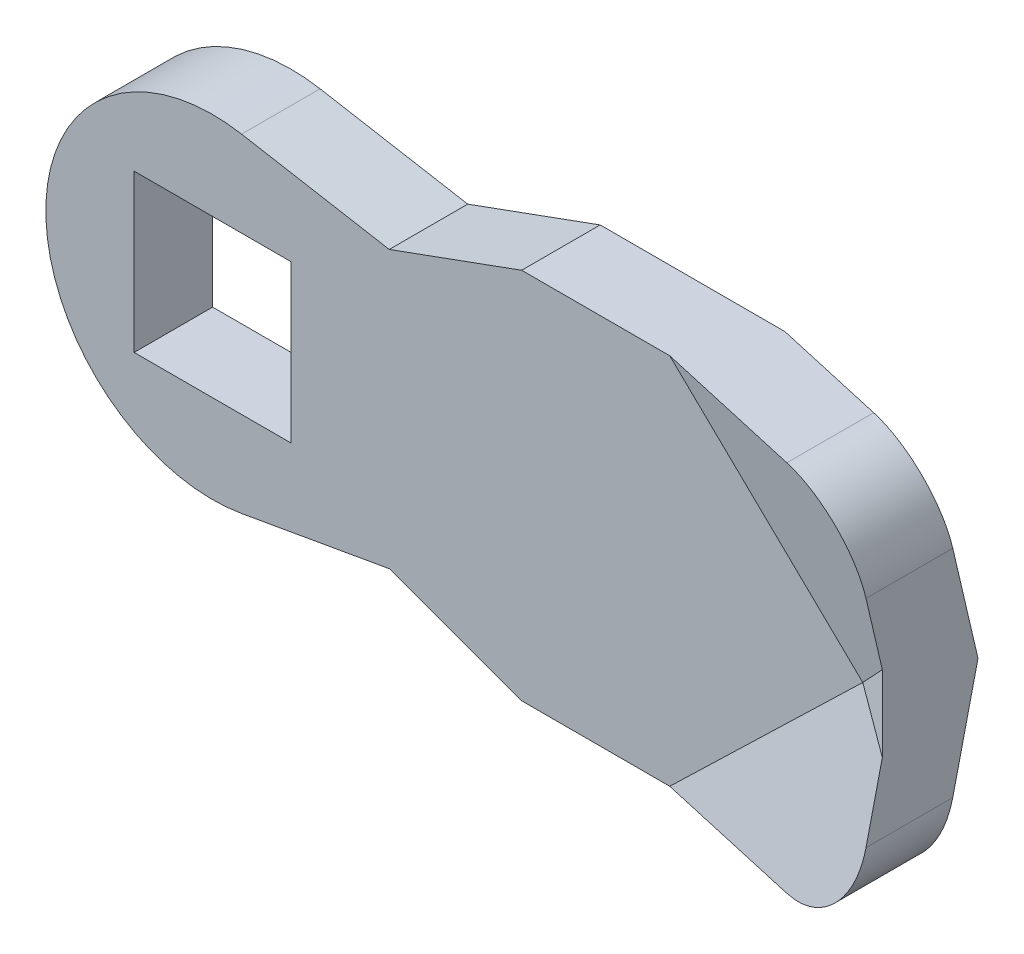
ISO-10303-21;
HEADER;
FILE_DESCRIPTION(('STEP AP214'),'2;1');
FILE_NAME('part.step','',(''),(''),'','','');
FILE_SCHEMA(('AUTOMOTIVE_DESIGN { 1 0 10303 214 1 1 1 1 }'));
ENDSEC;
DATA;
#1=APPLICATION_CONTEXT('core data for automotive mechanical design processes');
#2=APPLICATION_PROTOCOL_DEFINITION('international standard','automotive_design',2000,#1);
#3=PRODUCT_CONTEXT('',#1,'mechanical');
#4=PRODUCT('Part','Part','',(#3));
#5=PRODUCT_RELATED_PRODUCT_CATEGORY('part','',(#4));
#6=PRODUCT_DEFINITION_FORMATION('','',#4);
#7=PRODUCT_DEFINITION_CONTEXT('part definition',#1,'design');
#8=PRODUCT_DEFINITION('design','',#6,#7);
#9=PRODUCT_DEFINITION_SHAPE('','',#8);
#10=(LENGTH_UNIT() NAMED_UNIT(*) SI_UNIT(.MILLI.,.METRE.));
#11=(NAMED_UNIT(*) PLANE_ANGLE_UNIT() SI_UNIT($,.RADIAN.));
#12=(NAMED_UNIT(*) SI_UNIT($,.STERADIAN.) SOLID_ANGLE_UNIT());
#13=UNCERTAINTY_MEASURE_WITH_UNIT(LENGTH_MEASURE(1.E-05),#10,'distance_accuracy_value','');
#14=(GEOMETRIC_REPRESENTATION_CONTEXT(3) GLOBAL_UNCERTAINTY_ASSIGNED_CONTEXT((#13)) GLOBAL_UNIT_ASSIGNED_CONTEXT((#10,
#11,#12)) REPRESENTATION_CONTEXT('',''));
#15=CARTESIAN_POINT('',(0.,0.,0.));
#16=DIRECTION('',(0.,0.,1.));
#17=DIRECTION('',(1.,0.,0.));
#18=AXIS2_PLACEMENT_3D('',#15,#16,#17);
#19=CARTESIAN_POINT('',(6.5,2.8,-2.4));
#20=DIRECTION('',(0.,-1.,0.));
#21=DIRECTION('',(-1.,0.,0.));
#22=AXIS2_PLACEMENT_3D('',#19,#20,#21);
#23=PLANE('',#22);
#24=DIRECTION('',(0.707106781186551,0.,0.707106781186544));
#25=VECTOR('',#24,1.);
#26=CARTESIAN_POINT('',(7.5,2.8,-3.4));
#27=LINE('',#26,#25);
#28=CARTESIAN_POINT('',(8.5,2.8,-2.4));
#29=VERTEX_POINT('',#28);
#30=CARTESIAN_POINT('',(10.5,2.8,-0.400000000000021));
#31=VERTEX_POINT('',#30);
#32=EDGE_CURVE('E170',#29,#31,#27,.T.);
#33=ORIENTED_EDGE('',*,*,#32,.F.);
#34=DIRECTION('',(1.,0.,0.));
#35=VECTOR('',#34,1.);
#36=CARTESIAN_POINT('',(6.5,2.8,-2.4));
#37=LINE('',#36,#35);
#38=CARTESIAN_POINT('',(6.5,2.8,-2.4));
#39=VERTEX_POINT('',#38);
#40=EDGE_CURVE('E193',#39,#29,#37,.T.);
#41=ORIENTED_EDGE('',*,*,#40,.F.);
#42=DIRECTION('',(0.,0.,1.));
#43=VECTOR('',#42,1.);
#44=CARTESIAN_POINT('',(6.5,2.8,-2.4));
#45=LINE('',#44,#43);
#46=CARTESIAN_POINT('',(6.5,2.8,0.));
#47=VERTEX_POINT('',#46);
#48=EDGE_CURVE('E191',#39,#47,#45,.T.);
#49=ORIENTED_EDGE('',*,*,#48,.T.);
#50=DIRECTION('',(1.,0.,0.));
#51=VECTOR('',#50,1.);
#52=CARTESIAN_POINT('',(6.5,2.8,0.));
#53=LINE('',#52,#51);
#54=CARTESIAN_POINT('',(10.5,2.8,0.));
#55=VERTEX_POINT('',#54);
#56=EDGE_CURVE('E647',#47,#55,#53,.T.);
#57=ORIENTED_EDGE('',*,*,#56,.T.);
#58=DIRECTION('',(0.,0.,1.));
#59=VECTOR('',#58,1.);
#60=CARTESIAN_POINT('',(10.5,2.8,-2.4));
#61=LINE('',#60,#59);
#62=EDGE_CURVE('E188',#31,#55,#61,.T.);
#63=ORIENTED_EDGE('',*,*,#62,.F.);
#64=EDGE_LOOP('',(#33,#41,#49,#57,#63));
#65=FACE_BOUND('',#64,.T.);
#66=ADVANCED_FACE('F14',(#65),#23,.F.);
#67=CARTESIAN_POINT('',(10.5,-2.8,-2.4));
#68=DIRECTION('',(1.,0.,0.));
#69=DIRECTION('',(0.,-1.,0.));
#70=AXIS2_PLACEMENT_3D('',#67,#68,#69);
#71=PLANE('',#70);
#72=DIRECTION('',(0.,0.,1.));
#73=VECTOR('',#72,1.);
#74=CARTESIAN_POINT('',(10.5,-2.8,-2.4));
#75=LINE('',#74,#73);
#76=CARTESIAN_POINT('',(10.5,-2.8,-0.400000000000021));
#77=VERTEX_POINT('',#76);
#78=CARTESIAN_POINT('',(10.5,-2.8,0.));
#79=VERTEX_POINT('',#78);
#80=EDGE_CURVE('E180',#77,#79,#75,.T.);
#81=ORIENTED_EDGE('',*,*,#80,.F.);
#82=DIRECTION('',(0.,-1.,0.));
#83=VECTOR('',#82,1.);
#84=CARTESIAN_POINT('',(10.5,9.5,-0.400000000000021));
#85=LINE('',#84,#83);
#86=EDGE_CURVE('E167',#31,#77,#85,.T.);
#87=ORIENTED_EDGE('',*,*,#86,.F.);
#88=ORIENTED_EDGE('',*,*,#62,.T.);
#89=DIRECTION('',(0.,1.,0.));
#90=VECTOR('',#89,1.);
#91=CARTESIAN_POINT('',(10.5,-2.8,0.));
#92=LINE('',#91,#90);
#93=EDGE_CURVE('E187',#79,#55,#92,.T.);
#94=ORIENTED_EDGE('',*,*,#93,.F.);
#95=EDGE_LOOP('',(#81,#87,#88,#94));
#96=FACE_BOUND('',#95,.T.);
#97=ADVANCED_FACE('F185',(#96),#71,.T.);
#98=CARTESIAN_POINT('',(10.5,-2.8,-2.4));
#99=DIRECTION('',(0.,1.,0.));
#100=DIRECTION('',(1.,0.,0.));
#101=AXIS2_PLACEMENT_3D('',#98,#99,#100);
#102=PLANE('',#101);
#103=DIRECTION('',(0.707106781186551,0.,0.707106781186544));
#104=VECTOR('',#103,1.);
#105=CARTESIAN_POINT('',(8.5,-2.8,-2.4));
#106=LINE('',#105,#104);
#107=CARTESIAN_POINT('',(8.5,-2.8,-2.4));
#108=VERTEX_POINT('',#107);
#109=EDGE_CURVE('E29',#108,#77,#106,.T.);
#110=ORIENTED_EDGE('',*,*,#109,.T.);
#111=ORIENTED_EDGE('',*,*,#80,.T.);
#112=DIRECTION('',(-1.,0.,0.));
#113=VECTOR('',#112,1.);
#114=CARTESIAN_POINT('',(10.5,-2.8,0.));
#115=LINE('',#114,#113);
#116=CARTESIAN_POINT('',(6.5,-2.8,0.));
#117=VERTEX_POINT('',#116);
#118=EDGE_CURVE('E651',#79,#117,#115,.T.);
#119=ORIENTED_EDGE('',*,*,#118,.T.);
#120=DIRECTION('',(0.,0.,1.));
#121=VECTOR('',#120,1.);
#122=CARTESIAN_POINT('',(6.5,-2.8,-2.4));
#123=LINE('',#122,#121);
#124=CARTESIAN_POINT('',(6.5,-2.8,-2.4));
#125=VERTEX_POINT('',#124);
#126=EDGE_CURVE('E189',#125,#117,#123,.T.);
#127=ORIENTED_EDGE('',*,*,#126,.F.);
#128=DIRECTION('',(-1.,0.,0.));
#129=VECTOR('',#128,1.);
#130=CARTESIAN_POINT('',(10.5,-2.8,-2.4));
#131=LINE('',#130,#129);
#132=EDGE_CURVE('E182',#108,#125,#131,.T.);
#133=ORIENTED_EDGE('',*,*,#132,.F.);
#134=EDGE_LOOP('',(#110,#111,#119,#127,#133));
#135=FACE_BOUND('',#134,.T.);
#136=ADVANCED_FACE('F178',(#135),#102,.F.);
#137=CARTESIAN_POINT('',(6.5,-2.8,-2.4));
#138=DIRECTION('',(0.,0.,-1.));
#139=DIRECTION('',(1.,0.,0.));
#140=AXIS2_PLACEMENT_3D('',#137,#138,#139);
#141=PLANE('',#140);
#142=ORIENTED_EDGE('',*,*,#40,.T.);
#143=DIRECTION('',(0.,-1.,0.));
#144=VECTOR('',#143,1.);
#145=CARTESIAN_POINT('',(8.5,9.5,-2.4));
#146=LINE('',#145,#144);
#147=EDGE_CURVE('E174',#29,#108,#146,.T.);
#148=ORIENTED_EDGE('',*,*,#147,.T.);
#149=ORIENTED_EDGE('',*,*,#132,.T.);
#150=DIRECTION('',(0.,-1.,0.));
#151=VECTOR('',#150,1.);
#152=CARTESIAN_POINT('',(6.5,2.8,-2.4));
#153=LINE('',#152,#151);
#154=EDGE_CURVE('E643',#39,#125,#153,.T.);
#155=ORIENTED_EDGE('',*,*,#154,.F.);
#156=EDGE_LOOP('',(#142,#148,#149,#155));
#157=FACE_BOUND('',#156,.T.);
#158=ADVANCED_FACE('F596',(#157),#141,.T.);
#159=CARTESIAN_POINT('',(0.,-9.5,0.));
#160=DIRECTION('',(0.,0.,1.));
#161=DIRECTION('',(-1.,0.,0.));
#162=AXIS2_PLACEMENT_3D('',#159,#160,#161);
#163=PLANE('',#162);
#164=ORIENTED_EDGE('',*,*,#56,.F.);
#165=DIRECTION('',(0.,-1.,0.));
#166=VECTOR('',#165,1.);
#167=CARTESIAN_POINT('',(6.5,2.8,0.));
#168=LINE('',#167,#166);
#169=EDGE_CURVE('E37',#47,#117,#168,.T.);
#170=ORIENTED_EDGE('',*,*,#169,.T.);
#171=ORIENTED_EDGE('',*,*,#118,.F.);
#172=ORIENTED_EDGE('',*,*,#93,.T.);
#173=EDGE_LOOP('',(#164,#170,#171,#172));
#174=FACE_BOUND('',#173,.T.);
#175=DIRECTION('',(0.,-1.,0.));
#176=VECTOR('',#175,1.);
#177=CARTESIAN_POINT('',(-4.,4.,0.));
#178=LINE('',#177,#176);
#179=CARTESIAN_POINT('',(-4.,4.,0.));
#180=VERTEX_POINT('',#179);
#181=CARTESIAN_POINT('',(-4.,-4.,0.));
#182=VERTEX_POINT('',#181);
#183=EDGE_CURVE('E228',#180,#182,#178,.T.);
#184=ORIENTED_EDGE('',*,*,#183,.T.);
#185=DIRECTION('',(-1.,0.,0.));
#186=VECTOR('',#185,1.);
#187=CARTESIAN_POINT('',(4.,-4.,0.));
#188=LINE('',#187,#186);
#189=CARTESIAN_POINT('',(4.,-4.,0.));
#190=VERTEX_POINT('',#189);
#191=EDGE_CURVE('E231',#190,#182,#188,.T.);
#192=ORIENTED_EDGE('',*,*,#191,.F.);
#193=DIRECTION('',(0.,1.,0.));
#194=VECTOR('',#193,1.);
#195=CARTESIAN_POINT('',(4.,-4.,0.));
#196=LINE('',#195,#194);
#197=CARTESIAN_POINT('',(4.,4.,0.));
#198=VERTEX_POINT('',#197);
#199=EDGE_CURVE('E234',#190,#198,#196,.T.);
#200=ORIENTED_EDGE('',*,*,#199,.T.);
#201=DIRECTION('',(1.,0.,0.));
#202=VECTOR('',#201,1.);
#203=CARTESIAN_POINT('',(-4.,4.,0.));
#204=LINE('',#203,#202);
#205=EDGE_CURVE('E237',#180,#198,#204,.T.);
#206=ORIENTED_EDGE('',*,*,#205,.F.);
#207=EDGE_LOOP('',(#184,#192,#200,#206));
#208=FACE_BOUND('',#207,.T.);
#209=DIRECTION('',(0.939692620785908,0.342020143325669,0.));
#210=VECTOR('',#209,1.);
#211=CARTESIAN_POINT('',(9.,7.04418337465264,0.));
#212=LINE('',#211,#210);
#213=CARTESIAN_POINT('',(9.,7.04418337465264,0.));
#214=VERTEX_POINT('',#213);
#215=CARTESIAN_POINT('',(15.7473007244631,9.5,0.));
#216=VERTEX_POINT('',#215);
#217=EDGE_CURVE('E204',#214,#216,#212,.T.);
#218=ORIENTED_EDGE('',*,*,#217,.T.);
#219=DIRECTION('',(1.,0.,0.));
#220=VECTOR('',#219,1.);
#221=CARTESIAN_POINT('',(0.,9.5,0.));
#222=LINE('',#221,#220);
#223=CARTESIAN_POINT('',(25.1624620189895,9.5,0.));
#224=VERTEX_POINT('',#223);
#225=EDGE_CURVE('E289',#216,#224,#222,.T.);
#226=ORIENTED_EDGE('',*,*,#225,.T.);
#227=DIRECTION('',(-0.719339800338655,0.694658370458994,0.));
#228=VECTOR('',#227,1.);
#229=CARTESIAN_POINT('',(35.,0.,0.));
#230=LINE('',#229,#228);
#231=CARTESIAN_POINT('',(35.,0.,0.));
#232=VERTEX_POINT('',#231);
#233=EDGE_CURVE('E277',#232,#224,#230,.T.);
#234=ORIENTED_EDGE('',*,*,#233,.F.);
#235=DIRECTION('',(-0.719339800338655,-0.694658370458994,0.));
#236=VECTOR('',#235,1.);
#237=CARTESIAN_POINT('',(35.,0.,0.));
#238=LINE('',#237,#236);
#239=CARTESIAN_POINT('',(25.1624620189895,-9.5,0.));
#240=VERTEX_POINT('',#239);
#241=EDGE_CURVE('E280',#232,#240,#238,.T.);
#242=ORIENTED_EDGE('',*,*,#241,.T.);
#243=DIRECTION('',(1.,0.,0.));
#244=VECTOR('',#243,1.);
#245=CARTESIAN_POINT('',(0.,-9.5,0.));
#246=LINE('',#245,#244);
#247=CARTESIAN_POINT('',(15.7473007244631,-9.5,0.));
#248=VERTEX_POINT('',#247);
#249=EDGE_CURVE('E295',#248,#240,#246,.T.);
#250=ORIENTED_EDGE('',*,*,#249,.F.);
#251=DIRECTION('',(0.939692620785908,-0.342020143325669,0.));
#252=VECTOR('',#251,1.);
#253=CARTESIAN_POINT('',(9.,-7.04418337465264,0.));
#254=LINE('',#253,#252);
#255=CARTESIAN_POINT('',(9.,-7.04418337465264,0.));
#256=VERTEX_POINT('',#255);
#257=EDGE_CURVE('E207',#256,#248,#254,.T.);
#258=ORIENTED_EDGE('',*,*,#257,.F.);
#259=DIRECTION('',(0.984807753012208,0.173648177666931,0.));
#260=VECTOR('',#259,1.);
#261=CARTESIAN_POINT('',(1.47600951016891,-8.37086590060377,0.));
#262=LINE('',#261,#260);
#263=CARTESIAN_POINT('',(1.47600951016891,-8.37086590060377,0.));
#264=VERTEX_POINT('',#263);
#265=EDGE_CURVE('E209',#264,#256,#262,.T.);
#266=ORIENTED_EDGE('',*,*,#265,.F.);
#267=CARTESIAN_POINT('',(0.,0.,0.));
#268=DIRECTION('',(0.,0.,-1.));
#269=DIRECTION('',(1.,0.,0.));
#270=AXIS2_PLACEMENT_3D('',#267,#268,#269);
#271=CIRCLE('',#270,8.5);
#272=CARTESIAN_POINT('',(1.47600951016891,8.37086590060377,0.));
#273=VERTEX_POINT('',#272);
#274=EDGE_CURVE('E199',#264,#273,#271,.T.);
#275=ORIENTED_EDGE('',*,*,#274,.T.);
#276=DIRECTION('',(0.984807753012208,-0.173648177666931,0.));
#277=VECTOR('',#276,1.);
#278=CARTESIAN_POINT('',(1.47600951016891,8.37086590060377,0.));
#279=LINE('',#278,#277);
#280=EDGE_CURVE('E201',#273,#214,#279,.T.);
#281=ORIENTED_EDGE('',*,*,#280,.T.);
#282=EDGE_LOOP('',(#218,#226,#234,#242,#250,#258,#266,#275,#281));
#283=FACE_BOUND('',#282,.T.);
#284=ADVANCED_FACE('F382',(#174,#208,#283),#163,.F.);
#285=CARTESIAN_POINT('',(0.,-9.5,4.));
#286=DIRECTION('',(0.,0.,-1.));
#287=DIRECTION('',(0.,-1.,0.));
#288=AXIS2_PLACEMENT_3D('',#285,#286,#287);
#289=PLANE('',#288);
#290=DIRECTION('',(0.,-1.,0.));
#291=VECTOR('',#290,1.);
#292=CARTESIAN_POINT('',(-4.,-9.5,4.));
#293=LINE('',#292,#291);
#294=CARTESIAN_POINT('',(-4.,4.,4.));
#295=VERTEX_POINT('',#294);
#296=CARTESIAN_POINT('',(-4.,-4.,4.));
#297=VERTEX_POINT('',#296);
#298=EDGE_CURVE('E309',#295,#297,#293,.T.);
#299=ORIENTED_EDGE('',*,*,#298,.F.);
#300=DIRECTION('',(1.,0.,0.));
#301=VECTOR('',#300,1.);
#302=CARTESIAN_POINT('',(0.,4.,4.));
#303=LINE('',#302,#301);
#304=CARTESIAN_POINT('',(4.,4.,4.));
#305=VERTEX_POINT('',#304);
#306=EDGE_CURVE('E300',#295,#305,#303,.T.);
#307=ORIENTED_EDGE('',*,*,#306,.T.);
#308=DIRECTION('',(0.,1.,0.));
#309=VECTOR('',#308,1.);
#310=CARTESIAN_POINT('',(4.,-9.5,4.));
#311=LINE('',#310,#309);
#312=CARTESIAN_POINT('',(4.,-4.,4.));
#313=VERTEX_POINT('',#312);
#314=EDGE_CURVE('E303',#313,#305,#311,.T.);
#315=ORIENTED_EDGE('',*,*,#314,.F.);
#316=DIRECTION('',(-1.,0.,0.));
#317=VECTOR('',#316,1.);
#318=CARTESIAN_POINT('',(0.,-4.,4.));
#319=LINE('',#318,#317);
#320=EDGE_CURVE('E306',#313,#297,#319,.T.);
#321=ORIENTED_EDGE('',*,*,#320,.T.);
#322=EDGE_LOOP('',(#299,#307,#315,#321));
#323=FACE_BOUND('',#322,.T.);
#324=DIRECTION('',(0.939692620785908,0.342020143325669,0.));
#325=VECTOR('',#324,1.);
#326=CARTESIAN_POINT('',(-4.26439803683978,2.2163373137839,4.));
#327=LINE('',#326,#325);
#328=CARTESIAN_POINT('',(9.,7.04418337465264,4.));
#329=VERTEX_POINT('',#328);
#330=CARTESIAN_POINT('',(15.7473007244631,9.5,4.));
#331=VERTEX_POINT('',#330);
#332=EDGE_CURVE('E223',#329,#331,#327,.T.);
#333=ORIENTED_EDGE('',*,*,#332,.F.);
#334=DIRECTION('',(0.984807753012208,-0.173648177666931,0.));
#335=VECTOR('',#334,1.);
#336=CARTESIAN_POINT('',(3.10060519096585,8.08440584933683,4.));
#337=LINE('',#336,#335);
#338=CARTESIAN_POINT('',(1.47600951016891,8.37086590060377,4.));
#339=VERTEX_POINT('',#338);
#340=EDGE_CURVE('E320',#339,#329,#337,.T.);
#341=ORIENTED_EDGE('',*,*,#340,.F.);
#342=CARTESIAN_POINT('',(0.,0.,4.));
#343=DIRECTION('',(0.,0.,-1.));
#344=DIRECTION('',(0.,-1.,0.));
#345=AXIS2_PLACEMENT_3D('',#342,#343,#344);
#346=CIRCLE('',#345,8.5);
#347=CARTESIAN_POINT('',(1.47600951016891,-8.37086590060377,4.));
#348=VERTEX_POINT('',#347);
#349=EDGE_CURVE('E221',#348,#339,#346,.T.);
#350=ORIENTED_EDGE('',*,*,#349,.F.);
#351=DIRECTION('',(0.984807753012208,0.173648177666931,0.));
#352=VECTOR('',#351,1.);
#353=CARTESIAN_POINT('',(-0.148586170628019,-8.6573259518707,4.));
#354=LINE('',#353,#352);
#355=CARTESIAN_POINT('',(9.,-7.04418337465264,4.));
#356=VERTEX_POINT('',#355);
#357=EDGE_CURVE('E317',#348,#356,#354,.T.);
#358=ORIENTED_EDGE('',*,*,#357,.T.);
#359=DIRECTION('',(0.939692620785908,-0.342020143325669,0.));
#360=VECTOR('',#359,1.);
#361=CARTESIAN_POINT('',(1.84208425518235,-4.43891510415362,4.));
#362=LINE('',#361,#360);
#363=CARTESIAN_POINT('',(15.7473007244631,-9.5,4.));
#364=VERTEX_POINT('',#363);
#365=EDGE_CURVE('E225',#356,#364,#362,.T.);
#366=ORIENTED_EDGE('',*,*,#365,.T.);
#367=DIRECTION('',(-1.,0.,0.));
#368=VECTOR('',#367,1.);
#369=CARTESIAN_POINT('',(0.,-9.5,4.));
#370=LINE('',#369,#368);
#371=CARTESIAN_POINT('',(23.2915009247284,-9.5,4.));
#372=VERTEX_POINT('',#371);
#373=EDGE_CURVE('E297',#372,#364,#370,.T.);
#374=ORIENTED_EDGE('',*,*,#373,.F.);
#375=DIRECTION('',(0.719339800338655,0.694658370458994,0.));
#376=VECTOR('',#375,1.);
#377=CARTESIAN_POINT('',(34.0971672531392,0.934910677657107,4.));
#378=LINE('',#377,#376);
#379=CARTESIAN_POINT('',(33.1290389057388,0.,4.));
#380=VERTEX_POINT('',#379);
#381=EDGE_CURVE('E286',#380,#372,#378,.F.);
#382=ORIENTED_EDGE('',*,*,#381,.F.);
#383=DIRECTION('',(-0.719339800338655,0.694658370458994,0.));
#384=VECTOR('',#383,1.);
#385=CARTESIAN_POINT('',(34.0971672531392,-0.934910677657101,4.));
#386=LINE('',#385,#384);
#387=CARTESIAN_POINT('',(23.2915009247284,9.5,4.));
#388=VERTEX_POINT('',#387);
#389=EDGE_CURVE('E283',#380,#388,#386,.T.);
#390=ORIENTED_EDGE('',*,*,#389,.T.);
#391=DIRECTION('',(-1.,0.,0.));
#392=VECTOR('',#391,1.);
#393=CARTESIAN_POINT('',(0.,9.5,4.));
#394=LINE('',#393,#392);
#395=EDGE_CURVE('E292',#388,#331,#394,.T.);
#396=ORIENTED_EDGE('',*,*,#395,.T.);
#397=EDGE_LOOP('',(#333,#341,#350,#358,#366,#374,#382,#390,#396));
#398=FACE_BOUND('',#397,.T.);
#399=ADVANCED_FACE('F16',(#323,#398),#289,.F.);
#400=CARTESIAN_POINT('',(35.,9.5,4.));
#401=DIRECTION('',(0.,1.,0.));
#402=DIRECTION('',(1.,0.,0.));
#403=AXIS2_PLACEMENT_3D('',#400,#401,#402);
#404=PLANE('',#403);
#405=DIRECTION('',(0.975461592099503,0.,0.220169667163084));
#406=VECTOR('',#405,1.);
#407=CARTESIAN_POINT('',(30.2415087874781,9.5,5.56867367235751));
#408=LINE('',#407,#406);
#409=CARTESIAN_POINT('',(31.,9.5,5.73987134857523));
#410=VERTEX_POINT('',#409);
#411=EDGE_CURVE('E267',#388,#410,#408,.T.);
#412=ORIENTED_EDGE('',*,*,#411,.T.);
#413=DIRECTION('',(0.,0.,-1.));
#414=VECTOR('',#413,1.);
#415=CARTESIAN_POINT('',(31.,9.5,4.));
#416=LINE('',#415,#414);
#417=CARTESIAN_POINT('',(31.,9.5,1.31758011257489));
#418=VERTEX_POINT('',#417);
#419=EDGE_CURVE('E333',#410,#418,#416,.T.);
#420=ORIENTED_EDGE('',*,*,#419,.T.);
#421=DIRECTION('',(-0.975461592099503,0.,-0.220169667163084));
#422=VECTOR('',#421,1.);
#423=CARTESIAN_POINT('',(41.4731363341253,9.5,3.68145272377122));
#424=LINE('',#423,#422);
#425=EDGE_CURVE('E270',#418,#224,#424,.T.);
#426=ORIENTED_EDGE('',*,*,#425,.T.);
#427=ORIENTED_EDGE('',*,*,#225,.F.);
#428=DIRECTION('',(0.,0.,1.));
#429=VECTOR('',#428,1.);
#430=CARTESIAN_POINT('',(15.7473007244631,9.5,4.));
#431=LINE('',#430,#429);
#432=EDGE_CURVE('E311',#216,#331,#431,.T.);
#433=ORIENTED_EDGE('',*,*,#432,.T.);
#434=ORIENTED_EDGE('',*,*,#395,.F.);
#435=EDGE_LOOP('',(#412,#420,#426,#427,#433,#434));
#436=FACE_BOUND('',#435,.T.);
#437=ADVANCED_FACE('F355',(#436),#404,.T.);
#438=CARTESIAN_POINT('',(41.60659369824,-6.84132804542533,3.09016994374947));
#439=DIRECTION('',(0.214661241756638,-0.222288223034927,-0.951056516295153));
#440=DIRECTION('',(0.,-0.973756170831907,0.227593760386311));
#441=AXIS2_PLACEMENT_3D('',#438,#439,#440);
#442=PLANE('',#441);
#443=DIRECTION('',(0.,-0.973756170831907,0.227593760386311));
#444=VECTOR('',#443,1.);
#445=CARTESIAN_POINT('',(35.,-7.17180066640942,1.67624825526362));
#446=LINE('',#445,#444);
#447=CARTESIAN_POINT('',(35.,-5.5,1.28550218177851));
#448=VERTEX_POINT('',#447);
#449=EDGE_CURVE('E256',#232,#448,#446,.T.);
#450=ORIENTED_EDGE('',*,*,#449,.T.);
#451=CARTESIAN_POINT('',(31.,-5.5,0.382669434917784));
#452=DIRECTION('',(0.214661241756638,-0.222288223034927,-0.951056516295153));
#453=DIRECTION('',(0.660659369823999,-0.684132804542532,0.309016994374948));
#454=AXIS2_PLACEMENT_3D('',#451,#452,#453);
#455=ELLIPSE('',#454,4.20584889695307,4.);
#456=CARTESIAN_POINT('',(31.,-9.5,1.31758011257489));
#457=VERTEX_POINT('',#456);
#458=EDGE_CURVE('E327',#448,#457,#455,.T.);
#459=ORIENTED_EDGE('',*,*,#458,.T.);
#460=DIRECTION('',(0.975461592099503,0.,0.220169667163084));
#461=VECTOR('',#460,1.);
#462=CARTESIAN_POINT('',(41.4731363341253,-9.5,3.68145272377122));
#463=LINE('',#462,#461);
#464=EDGE_CURVE('E264',#240,#457,#463,.T.);
#465=ORIENTED_EDGE('',*,*,#464,.F.);
#466=ORIENTED_EDGE('',*,*,#241,.F.);
#467=EDGE_LOOP('',(#450,#459,#465,#466));
#468=FACE_BOUND('',#467,.T.);
#469=ADVANCED_FACE('F376',(#468),#442,.T.);
#470=CARTESIAN_POINT('',(41.60659369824,6.84132804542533,3.09016994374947));
#471=DIRECTION('',(-0.214661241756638,-0.222288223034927,0.951056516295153));
#472=DIRECTION('',(0.,0.973756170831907,0.227593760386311));
#473=AXIS2_PLACEMENT_3D('',#470,#471,#472);
#474=PLANE('',#473);
#475=ORIENTED_EDGE('',*,*,#425,.F.);
#476=CARTESIAN_POINT('',(31.,5.5,0.382669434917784));
#477=DIRECTION('',(-0.214661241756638,-0.222288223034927,0.951056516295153));
#478=DIRECTION('',(-0.660659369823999,-0.684132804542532,-0.309016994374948));
#479=AXIS2_PLACEMENT_3D('',#476,#477,#478);
#480=ELLIPSE('',#479,4.20584889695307,4.);
#481=CARTESIAN_POINT('',(35.,5.5,1.28550218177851));
#482=VERTEX_POINT('',#481);
#483=EDGE_CURVE('E22',#418,#482,#480,.F.);
#484=ORIENTED_EDGE('',*,*,#483,.T.);
#485=DIRECTION('',(0.,0.973756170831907,0.227593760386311));
#486=VECTOR('',#485,1.);
#487=CARTESIAN_POINT('',(35.,7.17180066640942,1.67624825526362));
#488=LINE('',#487,#486);
#489=EDGE_CURVE('E259',#232,#482,#488,.T.);
#490=ORIENTED_EDGE('',*,*,#489,.F.);
#491=ORIENTED_EDGE('',*,*,#233,.T.);
#492=EDGE_LOOP('',(#475,#484,#490,#491));
#493=FACE_BOUND('',#492,.T.);
#494=ADVANCED_FACE('F338',(#493),#474,.F.);
#495=CARTESIAN_POINT('',(29.8980946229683,16.3413280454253,7.09016994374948));
#496=DIRECTION('',(0.214661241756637,0.222288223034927,-0.951056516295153));
#497=DIRECTION('',(0.,-0.973756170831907,-0.227593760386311));
#498=AXIS2_PLACEMENT_3D('',#495,#496,#497);
#499=PLANE('',#498);
#500=DIRECTION('',(0.,-0.973756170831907,-0.227593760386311));
#501=VECTOR('',#500,1.);
#502=CARTESIAN_POINT('',(35.,16.086122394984,8.18206313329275));
#503=LINE('',#502,#501);
#504=CARTESIAN_POINT('',(35.,5.5,5.70779341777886));
#505=VERTEX_POINT('',#504);
#506=CARTESIAN_POINT('',(35.,1.93743692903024,4.87512385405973));
#507=VERTEX_POINT('',#506);
#508=EDGE_CURVE('E254',#505,#507,#503,.T.);
#509=ORIENTED_EDGE('',*,*,#508,.F.);
#510=CARTESIAN_POINT('',(31.,5.5,4.80496067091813));
#511=DIRECTION('',(0.214661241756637,0.222288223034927,-0.951056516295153));
#512=DIRECTION('',(-0.660659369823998,-0.684132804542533,-0.309016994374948));
#513=AXIS2_PLACEMENT_3D('',#510,#511,#512);
#514=ELLIPSE('',#513,4.20584889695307,4.);
#515=EDGE_CURVE('E9',#505,#410,#514,.F.);
#516=ORIENTED_EDGE('',*,*,#515,.T.);
#517=ORIENTED_EDGE('',*,*,#411,.F.);
#518=ORIENTED_EDGE('',*,*,#389,.F.);
#519=DIRECTION('',(-0.660659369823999,-0.684132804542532,-0.309016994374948));
#520=VECTOR('',#519,1.);
#521=CARTESIAN_POINT('',(39.7356326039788,6.84132804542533,7.09016994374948));
#522=LINE('',#521,#520);
#523=EDGE_CURVE('E275',#507,#380,#522,.T.);
#524=ORIENTED_EDGE('',*,*,#523,.F.);
#525=EDGE_LOOP('',(#509,#516,#517,#518,#524));
#526=FACE_BOUND('',#525,.T.);
#527=ADVANCED_FACE('F350',(#526),#499,.F.);
#528=CARTESIAN_POINT('',(35.,-9.5,4.));
#529=DIRECTION('',(0.,1.,0.));
#530=DIRECTION('',(1.,0.,0.));
#531=AXIS2_PLACEMENT_3D('',#528,#529,#530);
#532=PLANE('',#531);
#533=ORIENTED_EDGE('',*,*,#464,.T.);
#534=DIRECTION('',(0.,0.,-1.));
#535=VECTOR('',#534,1.);
#536=CARTESIAN_POINT('',(31.,-9.5,20.));
#537=LINE('',#536,#535);
#538=CARTESIAN_POINT('',(31.,-9.5,5.73987134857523));
#539=VERTEX_POINT('',#538);
#540=EDGE_CURVE('E329',#457,#539,#537,.F.);
#541=ORIENTED_EDGE('',*,*,#540,.T.);
#542=DIRECTION('',(-0.975461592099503,0.,-0.220169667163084));
#543=VECTOR('',#542,1.);
#544=CARTESIAN_POINT('',(30.2415087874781,-9.5,5.56867367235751));
#545=LINE('',#544,#543);
#546=EDGE_CURVE('E262',#539,#372,#545,.T.);
#547=ORIENTED_EDGE('',*,*,#546,.T.);
#548=ORIENTED_EDGE('',*,*,#373,.T.);
#549=DIRECTION('',(0.,0.,-1.));
#550=VECTOR('',#549,1.);
#551=CARTESIAN_POINT('',(15.7473007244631,-9.5,4.));
#552=LINE('',#551,#550);
#553=EDGE_CURVE('E314',#364,#248,#552,.T.);
#554=ORIENTED_EDGE('',*,*,#553,.T.);
#555=ORIENTED_EDGE('',*,*,#249,.T.);
#556=EDGE_LOOP('',(#533,#541,#547,#548,#554,#555));
#557=FACE_BOUND('',#556,.T.);
#558=ADVANCED_FACE('F378',(#557),#532,.F.);
#559=CARTESIAN_POINT('',(29.8980946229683,-16.3413280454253,7.09016994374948));
#560=DIRECTION('',(-0.214661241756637,0.222288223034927,0.951056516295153));
#561=DIRECTION('',(0.,0.973756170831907,-0.227593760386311));
#562=AXIS2_PLACEMENT_3D('',#559,#560,#561);
#563=PLANE('',#562);
#564=ORIENTED_EDGE('',*,*,#546,.F.);
#565=CARTESIAN_POINT('',(31.,-5.5,4.80496067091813));
#566=DIRECTION('',(-0.214661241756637,0.222288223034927,0.951056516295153));
#567=DIRECTION('',(0.660659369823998,-0.684132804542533,0.309016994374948));
#568=AXIS2_PLACEMENT_3D('',#565,#566,#567);
#569=ELLIPSE('',#568,4.20584889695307,4.);
#570=CARTESIAN_POINT('',(35.,-5.5,5.70779341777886));
#571=VERTEX_POINT('',#570);
#572=EDGE_CURVE('E331',#539,#571,#569,.T.);
#573=ORIENTED_EDGE('',*,*,#572,.T.);
#574=DIRECTION('',(0.,0.973756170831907,-0.227593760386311));
#575=VECTOR('',#574,1.);
#576=CARTESIAN_POINT('',(35.,-16.086122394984,8.18206313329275));
#577=LINE('',#576,#575);
#578=CARTESIAN_POINT('',(35.,-1.93743692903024,4.87512385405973));
#579=VERTEX_POINT('',#578);
#580=EDGE_CURVE('E252',#571,#579,#577,.T.);
#581=ORIENTED_EDGE('',*,*,#580,.T.);
#582=DIRECTION('',(-0.660659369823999,0.684132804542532,-0.309016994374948));
#583=VECTOR('',#582,1.);
#584=CARTESIAN_POINT('',(39.7356326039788,-6.84132804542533,7.09016994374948));
#585=LINE('',#584,#583);
#586=EDGE_CURVE('E272',#579,#380,#585,.T.);
#587=ORIENTED_EDGE('',*,*,#586,.T.);
#588=ORIENTED_EDGE('',*,*,#381,.T.);
#589=EDGE_LOOP('',(#564,#573,#581,#587,#588));
#590=FACE_BOUND('',#589,.T.);
#591=ADVANCED_FACE('F368',(#590),#563,.T.);
#592=CARTESIAN_POINT('',(45.9325767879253,-0.452246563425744,9.98873031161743));
#593=DIRECTION('',(0.423683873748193,0.,-0.905810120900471));
#594=DIRECTION('',(0.905810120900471,0.,0.423683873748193));
#595=AXIS2_PLACEMENT_3D('',#592,#593,#594);
#596=PLANE('',#595);
#597=DIRECTION('',(0.,-1.,0.));
#598=VECTOR('',#597,1.);
#599=CARTESIAN_POINT('',(35.,-0.452246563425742,4.87512385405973));
#600=LINE('',#599,#598);
#601=EDGE_CURVE('E249',#507,#579,#600,.T.);
#602=ORIENTED_EDGE('',*,*,#601,.F.);
#603=ORIENTED_EDGE('',*,*,#523,.T.);
#604=ORIENTED_EDGE('',*,*,#586,.F.);
#605=EDGE_LOOP('',(#602,#603,#604));
#606=FACE_BOUND('',#605,.T.);
#607=ADVANCED_FACE('F365',(#606),#596,.F.);
#608=CARTESIAN_POINT('',(35.,30.,20.));
#609=DIRECTION('',(1.,0.,0.));
#610=DIRECTION('',(0.,0.,1.));
#611=AXIS2_PLACEMENT_3D('',#608,#609,#610);
#612=PLANE('',#611);
#613=ORIENTED_EDGE('',*,*,#580,.F.);
#614=DIRECTION('',(0.,0.,-1.));
#615=VECTOR('',#614,1.);
#616=CARTESIAN_POINT('',(35.,-5.5,20.));
#617=LINE('',#616,#615);
#618=EDGE_CURVE('E324',#571,#448,#617,.T.);
#619=ORIENTED_EDGE('',*,*,#618,.T.);
#620=ORIENTED_EDGE('',*,*,#449,.F.);
#621=ORIENTED_EDGE('',*,*,#489,.T.);
#622=DIRECTION('',(0.,0.,-1.));
#623=VECTOR('',#622,1.);
#624=CARTESIAN_POINT('',(35.,5.5,20.));
#625=LINE('',#624,#623);
#626=EDGE_CURVE('E322',#482,#505,#625,.F.);
#627=ORIENTED_EDGE('',*,*,#626,.T.);
#628=ORIENTED_EDGE('',*,*,#508,.T.);
#629=ORIENTED_EDGE('',*,*,#601,.T.);
#630=EDGE_LOOP('',(#613,#619,#620,#621,#627,#628,#629));
#631=FACE_BOUND('',#630,.T.);
#632=ADVANCED_FACE('F345',(#631),#612,.T.);
#633=CARTESIAN_POINT('',(-4.,4.,6.64270409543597));
#634=DIRECTION('',(1.,0.,0.));
#635=DIRECTION('',(0.,0.,1.));
#636=AXIS2_PLACEMENT_3D('',#633,#634,#635);
#637=PLANE('',#636);
#638=ORIENTED_EDGE('',*,*,#298,.T.);
#639=DIRECTION('',(0.,0.,-1.));
#640=VECTOR('',#639,1.);
#641=CARTESIAN_POINT('',(-4.,-4.,6.64270409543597));
#642=LINE('',#641,#640);
#643=EDGE_CURVE('E247',#297,#182,#642,.T.);
#644=ORIENTED_EDGE('',*,*,#643,.T.);
#645=ORIENTED_EDGE('',*,*,#183,.F.);
#646=DIRECTION('',(0.,0.,-1.));
#647=VECTOR('',#646,1.);
#648=CARTESIAN_POINT('',(-4.,4.,6.64270409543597));
#649=LINE('',#648,#647);
#650=EDGE_CURVE('E240',#295,#180,#649,.T.);
#651=ORIENTED_EDGE('',*,*,#650,.F.);
#652=EDGE_LOOP('',(#638,#644,#645,#651));
#653=FACE_BOUND('',#652,.T.);
#654=ADVANCED_FACE('F505',(#653),#637,.T.);
#655=CARTESIAN_POINT('',(4.,-4.,6.64270409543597));
#656=DIRECTION('',(0.,-1.,0.));
#657=DIRECTION('',(-1.,0.,0.));
#658=AXIS2_PLACEMENT_3D('',#655,#656,#657);
#659=PLANE('',#658);
#660=DIRECTION('',(0.,0.,-1.));
#661=VECTOR('',#660,1.);
#662=CARTESIAN_POINT('',(4.,-4.,6.64270409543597));
#663=LINE('',#662,#661);
#664=EDGE_CURVE('E245',#313,#190,#663,.T.);
#665=ORIENTED_EDGE('',*,*,#664,.T.);
#666=ORIENTED_EDGE('',*,*,#191,.T.);
#667=ORIENTED_EDGE('',*,*,#643,.F.);
#668=ORIENTED_EDGE('',*,*,#320,.F.);
#669=EDGE_LOOP('',(#665,#666,#667,#668));
#670=FACE_BOUND('',#669,.T.);
#671=ADVANCED_FACE('F495',(#670),#659,.F.);
#672=CARTESIAN_POINT('',(4.,-4.,6.64270409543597));
#673=DIRECTION('',(-1.,0.,0.));
#674=DIRECTION('',(0.,0.,-1.));
#675=AXIS2_PLACEMENT_3D('',#672,#673,#674);
#676=PLANE('',#675);
#677=ORIENTED_EDGE('',*,*,#314,.T.);
#678=DIRECTION('',(0.,0.,-1.));
#679=VECTOR('',#678,1.);
#680=CARTESIAN_POINT('',(4.,4.,6.64270409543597));
#681=LINE('',#680,#679);
#682=EDGE_CURVE('E243',#305,#198,#681,.T.);
#683=ORIENTED_EDGE('',*,*,#682,.T.);
#684=ORIENTED_EDGE('',*,*,#199,.F.);
#685=ORIENTED_EDGE('',*,*,#664,.F.);
#686=EDGE_LOOP('',(#677,#683,#684,#685));
#687=FACE_BOUND('',#686,.T.);
#688=ADVANCED_FACE('F485',(#687),#676,.T.);
#689=CARTESIAN_POINT('',(-4.,4.,6.64270409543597));
#690=DIRECTION('',(0.,1.,0.));
#691=DIRECTION('',(1.,0.,0.));
#692=AXIS2_PLACEMENT_3D('',#689,#690,#691);
#693=PLANE('',#692);
#694=ORIENTED_EDGE('',*,*,#650,.T.);
#695=ORIENTED_EDGE('',*,*,#205,.T.);
#696=ORIENTED_EDGE('',*,*,#682,.F.);
#697=ORIENTED_EDGE('',*,*,#306,.F.);
#698=EDGE_LOOP('',(#694,#695,#696,#697));
#699=FACE_BOUND('',#698,.T.);
#700=ADVANCED_FACE('F475',(#699),#693,.F.);
#701=CARTESIAN_POINT('',(1.47600951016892,8.37086590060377,30.));
#702=DIRECTION('',(0.173648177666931,0.984807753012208,0.));
#703=DIRECTION('',(0.984807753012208,-0.173648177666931,0.));
#704=AXIS2_PLACEMENT_3D('',#701,#702,#703);
#705=PLANE('',#704);
#706=ORIENTED_EDGE('',*,*,#340,.T.);
#707=DIRECTION('',(0.,0.,-1.));
#708=VECTOR('',#707,1.);
#709=CARTESIAN_POINT('',(9.,7.04418337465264,30.));
#710=LINE('',#709,#708);
#711=EDGE_CURVE('E216',#329,#214,#710,.T.);
#712=ORIENTED_EDGE('',*,*,#711,.T.);
#713=ORIENTED_EDGE('',*,*,#280,.F.);
#714=DIRECTION('',(0.,0.,-1.));
#715=VECTOR('',#714,1.);
#716=CARTESIAN_POINT('',(1.47600951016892,8.37086590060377,30.));
#717=LINE('',#716,#715);
#718=EDGE_CURVE('E218',#339,#273,#717,.T.);
#719=ORIENTED_EDGE('',*,*,#718,.F.);
#720=EDGE_LOOP('',(#706,#712,#713,#719));
#721=FACE_BOUND('',#720,.T.);
#722=ADVANCED_FACE('F391',(#721),#705,.T.);
#723=CARTESIAN_POINT('',(1.47600951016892,-8.37086590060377,30.));
#724=DIRECTION('',(-0.173648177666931,0.984807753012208,0.));
#725=DIRECTION('',(0.984807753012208,0.173648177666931,0.));
#726=AXIS2_PLACEMENT_3D('',#723,#724,#725);
#727=PLANE('',#726);
#728=DIRECTION('',(0.,0.,-1.));
#729=VECTOR('',#728,1.);
#730=CARTESIAN_POINT('',(1.47600951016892,-8.37086590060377,30.));
#731=LINE('',#730,#729);
#732=EDGE_CURVE('E212',#348,#264,#731,.T.);
#733=ORIENTED_EDGE('',*,*,#732,.T.);
#734=ORIENTED_EDGE('',*,*,#265,.T.);
#735=DIRECTION('',(0.,0.,-1.));
#736=VECTOR('',#735,1.);
#737=CARTESIAN_POINT('',(9.,-7.04418337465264,30.));
#738=LINE('',#737,#736);
#739=EDGE_CURVE('E214',#356,#256,#738,.T.);
#740=ORIENTED_EDGE('',*,*,#739,.F.);
#741=ORIENTED_EDGE('',*,*,#357,.F.);
#742=EDGE_LOOP('',(#733,#734,#740,#741));
#743=FACE_BOUND('',#742,.T.);
#744=ADVANCED_FACE('F399',(#743),#727,.F.);
#745=CARTESIAN_POINT('',(9.,-7.04418337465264,30.));
#746=DIRECTION('',(0.342020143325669,0.939692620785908,0.));
#747=DIRECTION('',(0.939692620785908,-0.342020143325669,0.));
#748=AXIS2_PLACEMENT_3D('',#745,#746,#747);
#749=PLANE('',#748);
#750=ORIENTED_EDGE('',*,*,#739,.T.);
#751=ORIENTED_EDGE('',*,*,#257,.T.);
#752=ORIENTED_EDGE('',*,*,#553,.F.);
#753=ORIENTED_EDGE('',*,*,#365,.F.);
#754=EDGE_LOOP('',(#750,#751,#752,#753));
#755=FACE_BOUND('',#754,.T.);
#756=ADVANCED_FACE('F402',(#755),#749,.F.);
#757=CARTESIAN_POINT('',(9.,7.04418337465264,30.));
#758=DIRECTION('',(-0.342020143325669,0.939692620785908,0.));
#759=DIRECTION('',(0.939692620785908,0.342020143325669,0.));
#760=AXIS2_PLACEMENT_3D('',#757,#758,#759);
#761=PLANE('',#760);
#762=ORIENTED_EDGE('',*,*,#332,.T.);
#763=ORIENTED_EDGE('',*,*,#432,.F.);
#764=ORIENTED_EDGE('',*,*,#217,.F.);
#765=ORIENTED_EDGE('',*,*,#711,.F.);
#766=EDGE_LOOP('',(#762,#763,#764,#765));
#767=FACE_BOUND('',#766,.T.);
#768=ADVANCED_FACE('F389',(#767),#761,.T.);
#769=CARTESIAN_POINT('',(0.,0.,30.));
#770=DIRECTION('',(0.,0.,-1.));
#771=DIRECTION('',(1.,0.,0.));
#772=AXIS2_PLACEMENT_3D('',#769,#770,#771);
#773=CYLINDRICAL_SURFACE('',#772,8.5);
#774=ORIENTED_EDGE('',*,*,#349,.T.);
#775=ORIENTED_EDGE('',*,*,#718,.T.);
#776=ORIENTED_EDGE('',*,*,#274,.F.);
#777=ORIENTED_EDGE('',*,*,#732,.F.);
#778=EDGE_LOOP('',(#774,#775,#776,#777));
#779=FACE_BOUND('',#778,.T.);
#780=ADVANCED_FACE('F396',(#779),#773,.T.);
#781=CARTESIAN_POINT('',(31.,-5.5,20.));
#782=DIRECTION('',(0.,0.,1.));
#783=DIRECTION('',(-1.,0.,0.));
#784=AXIS2_PLACEMENT_3D('',#781,#782,#783);
#785=CYLINDRICAL_SURFACE('',#784,4.);
#786=ORIENTED_EDGE('',*,*,#572,.F.);
#787=ORIENTED_EDGE('',*,*,#540,.F.);
#788=ORIENTED_EDGE('',*,*,#458,.F.);
#789=ORIENTED_EDGE('',*,*,#618,.F.);
#790=EDGE_LOOP('',(#786,#787,#788,#789));
#791=FACE_BOUND('',#790,.T.);
#792=ADVANCED_FACE('F372',(#791),#785,.T.);
#793=CARTESIAN_POINT('',(31.,5.5,4.));
#794=DIRECTION('',(0.,0.,-1.));
#795=DIRECTION('',(1.,0.,0.));
#796=AXIS2_PLACEMENT_3D('',#793,#794,#795);
#797=CYLINDRICAL_SURFACE('',#796,4.);
#798=ORIENTED_EDGE('',*,*,#515,.F.);
#799=ORIENTED_EDGE('',*,*,#626,.F.);
#800=ORIENTED_EDGE('',*,*,#483,.F.);
#801=ORIENTED_EDGE('',*,*,#419,.F.);
#802=EDGE_LOOP('',(#798,#799,#800,#801));
#803=FACE_BOUND('',#802,.T.);
#804=ADVANCED_FACE('F348',(#803),#797,.T.);
#805=CARTESIAN_POINT('',(6.5,2.8,-2.4));
#806=DIRECTION('',(-1.,0.,0.));
#807=DIRECTION('',(0.,0.,-1.));
#808=AXIS2_PLACEMENT_3D('',#805,#806,#807);
#809=PLANE('',#808);
#810=ORIENTED_EDGE('',*,*,#48,.F.);
#811=ORIENTED_EDGE('',*,*,#154,.T.);
#812=ORIENTED_EDGE('',*,*,#126,.T.);
#813=ORIENTED_EDGE('',*,*,#169,.F.);
#814=EDGE_LOOP('',(#810,#811,#812,#813));
#815=FACE_BOUND('',#814,.T.);
#816=ADVANCED_FACE('F425',(#815),#809,.T.);
#817=CARTESIAN_POINT('',(8.5,9.5,-2.4));
#818=DIRECTION('',(0.707106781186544,0.,-0.707106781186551));
#819=DIRECTION('',(0.707106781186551,0.,0.707106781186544));
#820=AXIS2_PLACEMENT_3D('',#817,#818,#819);
#821=PLANE('',#820);
#822=ORIENTED_EDGE('',*,*,#32,.T.);
#823=ORIENTED_EDGE('',*,*,#86,.T.);
#824=ORIENTED_EDGE('',*,*,#109,.F.);
#825=ORIENTED_EDGE('',*,*,#147,.F.);
#826=EDGE_LOOP('',(#822,#823,#824,#825));
#827=FACE_BOUND('',#826,.T.);
#828=ADVANCED_FACE('F168',(#827),#821,.T.);
#829=CLOSED_SHELL('',(#66,#97,#136,#158,#284,#399,#437,#469,#494,#527,#558,#591,#607,#632,#654,
#671,#688,#700,#722,#744,#756,#768,#780,#792,#804,#816,#828));
#830=MANIFOLD_SOLID_BREP('B1',#829);
#831=ADVANCED_BREP_SHAPE_REPRESENTATION('',(#18,#830),#14);
#832=SHAPE_DEFINITION_REPRESENTATION(#9,#831);
ENDSEC;
END-ISO-10303-21;
